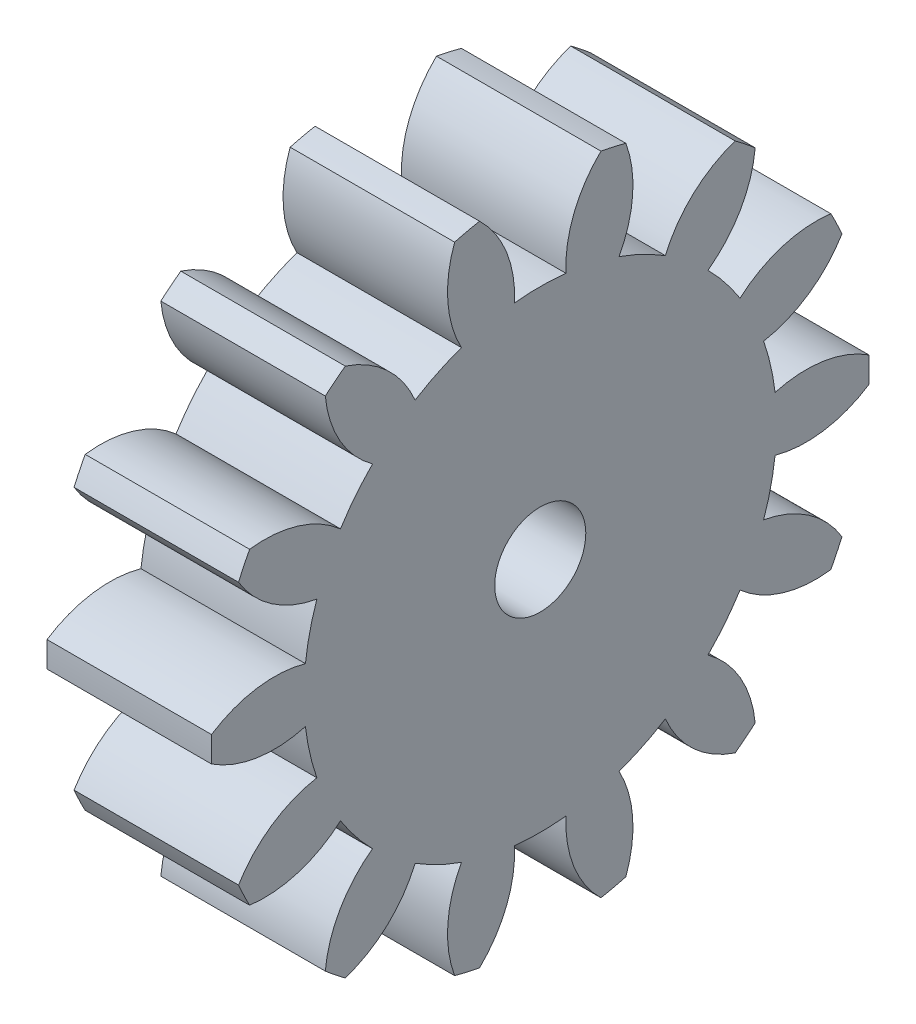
from build123d import *

# Parameters (mm, degrees)
BASPROSKE_W         = 6.35
BASPROSKE_H         = 12.7
TOOTHCUT_DEPTH      = 20.05
TEETHCUTS_COUNT     = 14
TEETHCUTS_ANGLE     = 334.285714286
BORSKE_R            = 3.175
BORE_DEPTH          = 50.8000508
BOSS_EXTRUDE1_START = 6.35
SKETCH1_R           = 3.175
SKETCH1_R_2         = 1.75895
BOSS_EXTRUDE1_DEPTH = 6.35
SCALE1_SCALE        = 0.5


with BuildPart() as part:
    # BasProSke → Base-Revolve (revolve)
    with BuildSketch(Plane(origin=(0, 0, 0), x_dir=(1, 0, 0), z_dir=(0, 1, 0)), mode=Mode.PRIVATE) as base_revolve_sk:
        with Locations((3.175, 6.35)):
            Rectangle(BASPROSKE_W, BASPROSKE_H)
    revolve(base_revolve_sk.sketch.rotate(Axis((-10, 0, 0), (1, 0, 0)), 180), axis=Axis((-10, 0, 0), (1, 0, 0)))

    # TooCutSke → ToothCut (cut, through all)
    with BuildSketch(Plane(origin=(0, 0, 0), x_dir=(0, 0, -1), z_dir=(1, 0, 0))):
        with BuildLine():
            ThreePointArc((0.992558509, 9.072723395), (0, 9.126855), (-0.992558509, 9.072723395))
            ThreePointArc((-0.992558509, 9.072723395), (-1.305543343, 10.937600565), (-2.365394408, 12.503628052))
            ThreePointArc((-2.365394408, 12.503628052), (0, 12.7254), (2.365394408, 12.503628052))
            ThreePointArc((2.365394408, 12.503628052), (1.305543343, 10.937600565), (0.992558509, 9.072723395))
        make_face()
    toothcut = extrude(amount=TOOTHCUT_DEPTH, mode=Mode.SUBTRACT)

    # TeethCuts: ToothCut ×14 about axis
    teethcuts_axis = Axis((-10, 0, 0), (1, 0, 0))
    for i in range(1, TEETHCUTS_COUNT):
        add(toothcut.rotate(teethcuts_axis, i * TEETHCUTS_ANGLE / (TEETHCUTS_COUNT - 1)), mode=Mode.SUBTRACT)

    # BorSke → Bore (cut, symmetric)
    with BuildSketch(Plane(origin=(0, 0, 0), x_dir=(0, 0, -1), z_dir=(1, 0, 0))):
        with Locations(Location((0, 0, 0), (0, 0, 180))):
            Circle(BORSKE_R)
    extrude(amount=BORE_DEPTH, both=True, mode=Mode.SUBTRACT)

    # Sketch1 → Boss-Extrude1 (add)
    with BuildSketch(Plane(origin=(0, 0, 0), x_dir=(0, 0, -1), z_dir=(1, 0, 0)).offset(BOSS_EXTRUDE1_START)):
        Circle(SKETCH1_R)
        Circle(SKETCH1_R_2, mode=Mode.SUBTRACT)
    extrude(amount=-BOSS_EXTRUDE1_DEPTH)


with BuildPart() as part_1:
    # Scale1: scaled about (3.175, 0, 0)
    add(part.part.scale(SCALE1_SCALE).moved(Location((1.5875, 0, 0))))


solid = part_1.part
